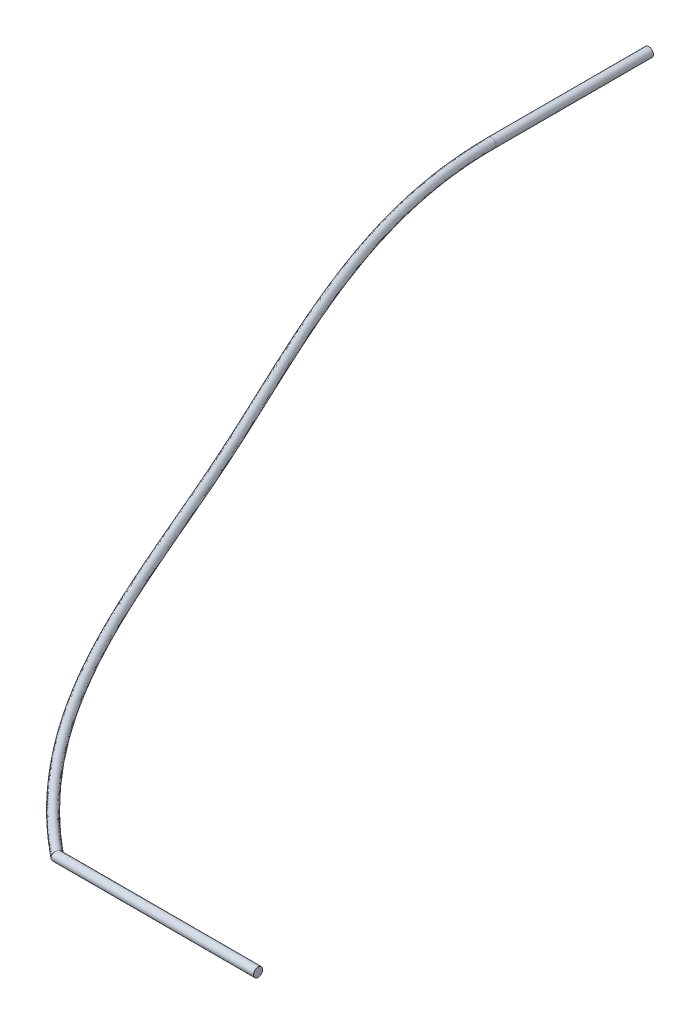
ISO-10303-21;
HEADER;
FILE_DESCRIPTION(('STEP AP214'),'2;1');
FILE_NAME('part.step','',(''),(''),'','','');
FILE_SCHEMA(('AUTOMOTIVE_DESIGN { 1 0 10303 214 1 1 1 1 }'));
ENDSEC;
DATA;
#1=APPLICATION_CONTEXT('core data for automotive mechanical design processes');
#2=APPLICATION_PROTOCOL_DEFINITION('international standard','automotive_design',2000,#1);
#3=PRODUCT_CONTEXT('',#1,'mechanical');
#4=PRODUCT('Part','Part','',(#3));
#5=PRODUCT_RELATED_PRODUCT_CATEGORY('part','',(#4));
#6=PRODUCT_DEFINITION_FORMATION('','',#4);
#7=PRODUCT_DEFINITION_CONTEXT('part definition',#1,'design');
#8=PRODUCT_DEFINITION('design','',#6,#7);
#9=PRODUCT_DEFINITION_SHAPE('','',#8);
#10=(LENGTH_UNIT() NAMED_UNIT(*) SI_UNIT(.MILLI.,.METRE.));
#11=(NAMED_UNIT(*) PLANE_ANGLE_UNIT() SI_UNIT($,.RADIAN.));
#12=(NAMED_UNIT(*) SI_UNIT($,.STERADIAN.) SOLID_ANGLE_UNIT());
#13=UNCERTAINTY_MEASURE_WITH_UNIT(LENGTH_MEASURE(1.E-05),#10,'distance_accuracy_value','');
#14=(GEOMETRIC_REPRESENTATION_CONTEXT(3) GLOBAL_UNCERTAINTY_ASSIGNED_CONTEXT((#13)) GLOBAL_UNIT_ASSIGNED_CONTEXT((#10,
#11,#12)) REPRESENTATION_CONTEXT('',''));
#15=CARTESIAN_POINT('',(0.,0.,0.));
#16=DIRECTION('',(0.,0.,1.));
#17=DIRECTION('',(1.,0.,0.));
#18=AXIS2_PLACEMENT_3D('',#15,#16,#17);
#19=CARTESIAN_POINT('',(52.7031861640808,0.,86.9387272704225));
#20=DIRECTION('',(1.,0.,0.));
#21=DIRECTION('',(0.,0.,-1.));
#22=AXIS2_PLACEMENT_3D('',#19,#20,#21);
#23=PLANE('',#22);
#24=CARTESIAN_POINT('',(52.7031861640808,0.,86.9387272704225));
#25=DIRECTION('',(1.,0.,0.));
#26=DIRECTION('',(0.,0.,-1.));
#27=AXIS2_PLACEMENT_3D('',#24,#25,#26);
#28=CIRCLE('',#27,0.4);
#29=CARTESIAN_POINT('',(52.7031861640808,0.,86.5387272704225));
#30=VERTEX_POINT('',#29);
#31=EDGE_CURVE('E38',#30,#30,#28,.T.);
#32=ORIENTED_EDGE('',*,*,#31,.T.);
#33=EDGE_LOOP('',(#32));
#34=FACE_BOUND('',#33,.T.);
#35=ADVANCED_FACE('F35',(#34),#23,.T.);
#36=CARTESIAN_POINT('',(0.,0.,0.));
#37=DIRECTION('',(0.,0.,1.));
#38=DIRECTION('',(1.,0.,0.));
#39=AXIS2_PLACEMENT_3D('',#36,#37,#38);
#40=PLANE('',#39);
#41=CARTESIAN_POINT('',(0.,0.,0.));
#42=DIRECTION('',(0.,0.,1.));
#43=DIRECTION('',(1.,0.,0.));
#44=AXIS2_PLACEMENT_3D('',#41,#42,#43);
#45=CIRCLE('',#44,0.4);
#46=CARTESIAN_POINT('',(0.4,0.,0.));
#47=VERTEX_POINT('',#46);
#48=EDGE_CURVE('E62',#47,#47,#45,.T.);
#49=ORIENTED_EDGE('',*,*,#48,.F.);
#50=EDGE_LOOP('',(#49));
#51=FACE_BOUND('',#50,.T.);
#52=ADVANCED_FACE('F83',(#51),#40,.F.);
#53=CARTESIAN_POINT('',(34.8420573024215,0.,86.9387272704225));
#54=DIRECTION('',(1.,0.,0.));
#55=DIRECTION('',(0.,0.,-1.));
#56=AXIS2_PLACEMENT_3D('',#53,#54,#55);
#57=CYLINDRICAL_SURFACE('',#56,0.4);
#58=CARTESIAN_POINT('',(35.0986006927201,-0.400000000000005,86.9387272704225));
#59=CARTESIAN_POINT('',(35.0980383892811,-0.400000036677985,86.9403077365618));
#60=CARTESIAN_POINT('',(35.0974760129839,-0.399990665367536,86.9418884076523));
#61=CARTESIAN_POINT('',(35.0885574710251,-0.39969296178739,86.9669557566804));
#62=CARTESIAN_POINT('',(35.0801942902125,-0.397338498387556,86.9904621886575));
#63=CARTESIAN_POINT('',(35.0636998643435,-0.388505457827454,87.0368232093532));
#64=CARTESIAN_POINT('',(35.0555693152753,-0.382015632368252,87.0596758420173));
#65=CARTESIAN_POINT('',(35.0397892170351,-0.36501893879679,87.1040291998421));
#66=CARTESIAN_POINT('',(35.0321397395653,-0.354511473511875,87.1255297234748));
#67=CARTESIAN_POINT('',(35.0175688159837,-0.329696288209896,87.1664845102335));
#68=CARTESIAN_POINT('',(35.0106471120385,-0.315389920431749,87.1859394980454));
#69=CARTESIAN_POINT('',(34.9979732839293,-0.283818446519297,87.2215621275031));
#70=CARTESIAN_POINT('',(34.9921912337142,-0.266660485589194,87.2378138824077));
#71=CARTESIAN_POINT('',(34.9817473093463,-0.229533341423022,87.2671688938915));
#72=CARTESIAN_POINT('',(34.9770851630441,-0.209564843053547,87.2802729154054));
#73=CARTESIAN_POINT('',(34.9693061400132,-0.16864006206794,87.30213763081));
#74=CARTESIAN_POINT('',(34.9661149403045,-0.147809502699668,87.3111072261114));
#75=CARTESIAN_POINT('',(34.961022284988,-0.104790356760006,87.3254212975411));
#76=CARTESIAN_POINT('',(34.9591203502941,-0.082602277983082,87.3307671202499));
#77=CARTESIAN_POINT('',(34.9567478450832,-0.0387181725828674,87.3374355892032));
#78=CARTESIAN_POINT('',(34.9562092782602,-0.0170546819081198,87.3389493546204));
#79=CARTESIAN_POINT('',(34.9563860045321,0.0262250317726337,87.3384526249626));
#80=CARTESIAN_POINT('',(34.9571011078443,0.0478412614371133,87.336442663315));
#81=CARTESIAN_POINT('',(34.9597295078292,0.0899568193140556,87.329054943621));
#82=CARTESIAN_POINT('',(34.9616181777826,0.110469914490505,87.3237464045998));
#83=CARTESIAN_POINT('',(34.9665051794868,0.150311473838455,87.3100103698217));
#84=CARTESIAN_POINT('',(34.9695050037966,0.169638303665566,87.3015786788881));
#85=CARTESIAN_POINT('',(34.9765728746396,0.20691757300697,87.2817128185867));
#86=CARTESIAN_POINT('',(34.9806588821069,0.224839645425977,87.2702281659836));
#87=CARTESIAN_POINT('',(34.989739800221,0.258504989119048,87.2447041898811));
#88=CARTESIAN_POINT('',(34.9947351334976,0.274247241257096,87.2306636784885));
#89=CARTESIAN_POINT('',(35.0060751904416,0.304805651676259,87.1987899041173));
#90=CARTESIAN_POINT('',(35.0125077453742,0.319332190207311,87.1807097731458));
#91=CARTESIAN_POINT('',(35.0260889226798,0.344948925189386,87.1425368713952));
#92=CARTESIAN_POINT('',(35.0332368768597,0.356042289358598,87.1224459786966));
#93=CARTESIAN_POINT('',(35.0480511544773,0.374611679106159,87.0808072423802));
#94=CARTESIAN_POINT('',(35.0557181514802,0.382082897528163,87.0592575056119));
#95=CARTESIAN_POINT('',(35.0713414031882,0.39324455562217,87.0153450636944));
#96=CARTESIAN_POINT('',(35.0792970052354,0.396943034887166,86.9929841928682));
#97=CARTESIAN_POINT('',(35.0904947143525,0.399453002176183,86.9615107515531));
#98=CARTESIAN_POINT('',(35.0937036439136,0.399864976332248,86.9524914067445));
#99=CARTESIAN_POINT('',(35.0974759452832,0.399990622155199,86.9418885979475));
#100=CARTESIAN_POINT('',(35.09803831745,0.399999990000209,86.9403079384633));
#101=CARTESIAN_POINT('',(35.0986006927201,0.400000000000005,86.9387272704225));
#102=B_SPLINE_CURVE_WITH_KNOTS('',3,(#58,#59,#60,#61,#62,#63,#64,#65,#66,#67,#68,#69,#70,#71,
#72,#73,#74,#75,#76,#77,#78,#79,#80,#81,#82,#83,#84,#85,#86,#87,#88,#89,#90,#91,#92,#93,#94,#95,
#96,#97,#98,#99,#100,#101),.UNSPECIFIED.,.F.,.F.,(4,2,2,2,2,2,2,2,2,2,2,2,2,2,2,2,2,2,2,2,2,4),
(0.,0.00503315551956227,0.0798146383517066,0.154800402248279,0.229797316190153,
0.304767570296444,0.377381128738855,0.449977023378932,0.518334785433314,0.586667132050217,
0.651517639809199,0.71635833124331,0.779882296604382,0.843491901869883,0.908226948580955,
0.972992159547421,1.04484114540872,1.11662363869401,1.18850113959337,1.26022514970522,
1.28895548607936,1.29398864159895),.UNSPECIFIED.);
#103=CARTESIAN_POINT('',(35.0986006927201,-0.400000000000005,86.9387272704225));
#104=VERTEX_POINT('',#103);
#105=CARTESIAN_POINT('',(35.0986006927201,0.400000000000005,86.9387272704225));
#106=VERTEX_POINT('',#105);
#107=EDGE_CURVE('E43',#104,#106,#102,.T.);
#108=ORIENTED_EDGE('',*,*,#107,.F.);
#109=CARTESIAN_POINT('',(35.0986006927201,-0.400000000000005,86.9387272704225));
#110=CARTESIAN_POINT('',(35.0991629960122,-0.40000003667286,86.9371468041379));
#111=CARTESIAN_POINT('',(35.0997253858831,-0.399990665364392,86.9355661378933));
#112=CARTESIAN_POINT('',(35.1086471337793,-0.399692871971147,86.9104911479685));
#113=CARTESIAN_POINT('',(35.1170165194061,-0.397336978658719,86.8869781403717));
#114=CARTESIAN_POINT('',(35.1335289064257,-0.388499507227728,86.8406063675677));
#115=CARTESIAN_POINT('',(35.1416712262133,-0.382006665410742,86.8177495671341));
#116=CARTESIAN_POINT('',(35.1574792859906,-0.365003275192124,86.7733902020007));
#117=CARTESIAN_POINT('',(35.1651449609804,-0.35449218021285,86.7518878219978));
#118=CARTESIAN_POINT('',(35.1797512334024,-0.329669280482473,86.7109306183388));
#119=CARTESIAN_POINT('',(35.1866920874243,-0.315358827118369,86.6914750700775));
#120=CARTESIAN_POINT('',(35.1994055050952,-0.283775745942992,86.6558489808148));
#121=CARTESIAN_POINT('',(35.2052078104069,-0.266609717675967,86.6395947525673));
#122=CARTESIAN_POINT('',(35.215690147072,-0.22946420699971,86.6102367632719));
#123=CARTESIAN_POINT('',(35.2203704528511,-0.209485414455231,86.5971322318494));
#124=CARTESIAN_POINT('',(35.2281790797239,-0.168543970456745,86.5752721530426));
#125=CARTESIAN_POINT('',(35.2313823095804,-0.147707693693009,86.5663066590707));
#126=CARTESIAN_POINT('',(35.2364935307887,-0.104676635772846,86.5520022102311));
#127=CARTESIAN_POINT('',(35.2384020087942,-0.0824823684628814,86.5466618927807));
#128=CARTESIAN_POINT('',(35.2407801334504,-0.038597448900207,86.5400075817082));
#129=CARTESIAN_POINT('',(35.2413187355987,-0.0169396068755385,86.5385006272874));
#130=CARTESIAN_POINT('',(35.2411370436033,0.0263275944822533,86.539008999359));
#131=CARTESIAN_POINT('',(35.2404169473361,0.0479369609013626,86.5410237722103));
#132=CARTESIAN_POINT('',(35.2377745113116,0.0900330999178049,86.5484177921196));
#133=CARTESIAN_POINT('',(35.2358771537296,0.110533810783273,86.5537271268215));
#134=CARTESIAN_POINT('',(35.2309699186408,0.15035118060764,86.567460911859));
#135=CARTESIAN_POINT('',(35.2279585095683,0.169666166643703,86.5758896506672));
#136=CARTESIAN_POINT('',(35.2208649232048,0.206927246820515,86.5957479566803));
#137=CARTESIAN_POINT('',(35.2167644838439,0.224842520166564,86.607228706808));
#138=CARTESIAN_POINT('',(35.207654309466,0.258494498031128,86.6327422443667));
#139=CARTESIAN_POINT('',(35.2026442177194,0.274230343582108,86.6467760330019));
#140=CARTESIAN_POINT('',(35.1916051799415,0.303889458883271,86.6777060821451));
#141=CARTESIAN_POINT('',(35.185538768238,0.317688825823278,86.6947077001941));
#142=CARTESIAN_POINT('',(35.1727592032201,0.342238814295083,86.7305350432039));
#143=CARTESIAN_POINT('',(35.1660466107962,0.352992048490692,86.749359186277));
#144=CARTESIAN_POINT('',(35.1514089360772,0.372254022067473,86.7904218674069));
#145=CARTESIAN_POINT('',(35.1434308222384,0.380402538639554,86.8128106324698));
#146=CARTESIAN_POINT('',(35.1271483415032,0.392587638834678,86.8585221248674));
#147=CARTESIAN_POINT('',(35.1188446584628,0.396632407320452,86.8818428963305));
#148=CARTESIAN_POINT('',(35.1070997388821,0.399401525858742,86.9148417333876));
#149=CARTESIAN_POINT('',(35.1036940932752,0.399858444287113,86.9244118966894));
#150=CARTESIAN_POINT('',(35.0997254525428,0.399990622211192,86.9355659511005));
#151=CARTESIAN_POINT('',(35.0991630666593,0.399999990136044,86.9371466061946));
#152=CARTESIAN_POINT('',(35.0986006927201,0.400000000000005,86.9387272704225));
#153=B_SPLINE_CURVE_WITH_KNOTS('',3,(#109,#110,#111,#112,#113,#114,#115,#116,#117,#118,#119,
#120,#121,#122,#123,#124,#125,#126,#127,#128,#129,#130,#131,#132,#133,#134,#135,#136,#137,#138,
#139,#140,#141,#142,#143,#144,#145,#146,#147,#148,#149,#150,#151,#152),.UNSPECIFIED.,.F.,.F.,(4,
2,2,2,2,2,2,2,2,2,2,2,2,2,2,2,2,2,2,2,2,4),(0.,0.00503315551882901,0.0798394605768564,
0.154850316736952,0.22987137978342,0.304865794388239,0.377515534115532,0.450147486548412,
0.51852071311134,0.586868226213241,0.651700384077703,0.71652235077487,0.780013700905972,
0.843592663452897,0.908313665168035,0.973060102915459,1.04092690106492,1.10873531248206,
1.1837536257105,1.25862202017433,1.2891078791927,1.29414103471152),.UNSPECIFIED.);
#154=EDGE_CURVE('E11',#104,#106,#153,.T.);
#155=ORIENTED_EDGE('',*,*,#154,.T.);
#156=EDGE_LOOP('',(#108,#155));
#157=FACE_BOUND('',#156,.T.);
#158=ORIENTED_EDGE('',*,*,#31,.F.);
#159=EDGE_LOOP('',(#158));
#160=FACE_BOUND('',#159,.T.);
#161=ADVANCED_FACE('F50',(#157,#160),#57,.T.);
#162=CARTESIAN_POINT('',(0.,0.,0.));
#163=DIRECTION('',(0.,0.,1.));
#164=DIRECTION('',(1.,0.,0.));
#165=AXIS2_PLACEMENT_3D('',#162,#163,#164);
#166=CYLINDRICAL_SURFACE('',#165,0.4);
#167=CARTESIAN_POINT('',(0.,0.,13.7801629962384));
#168=DIRECTION('',(0.,0.,1.));
#169=DIRECTION('',(1.,0.,0.));
#170=AXIS2_PLACEMENT_3D('',#167,#168,#169);
#171=CIRCLE('',#170,0.4);
#172=CARTESIAN_POINT('',(0.4,0.,13.7801629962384));
#173=VERTEX_POINT('',#172);
#174=EDGE_CURVE('E53',#173,#173,#171,.T.);
#175=ORIENTED_EDGE('',*,*,#174,.F.);
#176=EDGE_LOOP('',(#175));
#177=FACE_BOUND('',#176,.T.);
#178=ORIENTED_EDGE('',*,*,#48,.T.);
#179=EDGE_LOOP('',(#178));
#180=FACE_BOUND('',#179,.T.);
#181=ADVANCED_FACE('F57',(#177,#180),#166,.T.);
#182=CARTESIAN_POINT('',(0.4,0.,13.7801629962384));
#183=CARTESIAN_POINT('',(0.4,0.,14.1557957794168));
#184=CARTESIAN_POINT('',(0.406561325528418,0.,14.4969142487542));
#185=CARTESIAN_POINT('',(0.432323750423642,0.,15.2153948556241));
#186=CARTESIAN_POINT('',(0.451524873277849,0.,15.5752057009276));
#187=CARTESIAN_POINT('',(0.527363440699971,0.,16.6562900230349));
#188=CARTESIAN_POINT('',(0.602236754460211,0.,17.3792169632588));
#189=CARTESIAN_POINT('',(0.893987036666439,0.,19.5540618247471));
#190=CARTESIAN_POINT('',(1.17800967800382,0.,21.0120561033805));
#191=CARTESIAN_POINT('',(2.25168446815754,0.,25.4052139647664));
#192=CARTESIAN_POINT('',(3.26309523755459,0.,28.3594886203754));
#193=CARTESIAN_POINT('',(6.80133298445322,0.,37.2550862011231));
#194=CARTESIAN_POINT('',(9.83222421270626,0.,43.2275374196));
#195=CARTESIAN_POINT('',(15.6571630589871,0.,56.1358770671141));
#196=CARTESIAN_POINT('',(18.2860798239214,0.,63.0035758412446));
#197=CARTESIAN_POINT('',(23.3597556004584,0.,72.5537941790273));
#198=CARTESIAN_POINT('',(25.2388505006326,0.,75.6122210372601));
#199=CARTESIAN_POINT('',(29.6922712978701,0.,81.3929141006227));
#200=CARTESIAN_POINT('',(32.2538493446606,0.,84.1051906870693));
#201=CARTESIAN_POINT('',(35.4172742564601,0.,86.6824064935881));
#202=CARTESIAN_POINT('',(35.4838415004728,0.,86.7366371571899));
#203=CARTESIAN_POINT('',(35.5501395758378,0.,86.7906490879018));
#204=CARTESIAN_POINT('',(0.4,0.8,13.7801629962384));
#205=CARTESIAN_POINT('',(0.4,0.8,14.1557957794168));
#206=CARTESIAN_POINT('',(0.406561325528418,0.8,14.4969142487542));
#207=CARTESIAN_POINT('',(0.432323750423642,0.8,15.2153948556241));
#208=CARTESIAN_POINT('',(0.451524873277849,0.8,15.5752057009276));
#209=CARTESIAN_POINT('',(0.527363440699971,0.8,16.6562900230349));
#210=CARTESIAN_POINT('',(0.602236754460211,0.8,17.3792169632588));
#211=CARTESIAN_POINT('',(0.893987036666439,0.8,19.5540618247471));
#212=CARTESIAN_POINT('',(1.17800967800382,0.8,21.0120561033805));
#213=CARTESIAN_POINT('',(2.25168446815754,0.8,25.4052139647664));
#214=CARTESIAN_POINT('',(3.26309523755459,0.8,28.3594886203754));
#215=CARTESIAN_POINT('',(6.80133298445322,0.8,37.2550862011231));
#216=CARTESIAN_POINT('',(9.83222421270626,0.8,43.2275374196));
#217=CARTESIAN_POINT('',(15.6571630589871,0.8,56.1358770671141));
#218=CARTESIAN_POINT('',(18.2860798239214,0.8,63.0035758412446));
#219=CARTESIAN_POINT('',(23.3597556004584,0.8,72.5537941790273));
#220=CARTESIAN_POINT('',(25.2388505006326,0.8,75.6122210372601));
#221=CARTESIAN_POINT('',(29.6922712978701,0.8,81.3929141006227));
#222=CARTESIAN_POINT('',(32.2538493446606,0.8,84.1051906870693));
#223=CARTESIAN_POINT('',(35.4172742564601,0.8,86.6824064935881));
#224=CARTESIAN_POINT('',(35.4838415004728,0.8,86.7366371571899));
#225=CARTESIAN_POINT('',(35.5501395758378,0.8,86.7906490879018));
#226=CARTESIAN_POINT('',(-0.4,0.8,13.7801629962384));
#227=CARTESIAN_POINT('',(-0.4,0.8,14.1606820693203));
#228=CARTESIAN_POINT('',(-0.393259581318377,0.8,14.5162470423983));
#229=CARTESIAN_POINT('',(-0.366827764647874,0.8,15.2533961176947));
#230=CARTESIAN_POINT('',(-0.347136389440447,0.8,15.622315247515));
#231=CARTESIAN_POINT('',(-0.269430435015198,0.8,16.7300193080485));
#232=CARTESIAN_POINT('',(-0.192784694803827,0.8,17.469749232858));
#233=CARTESIAN_POINT('',(0.105337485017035,0.8,19.6920932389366));
#234=CARTESIAN_POINT('',(0.394983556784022,0.8,21.1778492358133));
#235=CARTESIAN_POINT('',(1.48635360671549,0.8,25.64341083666));
#236=CARTESIAN_POINT('',(2.51035767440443,0.8,28.6315740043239));
#237=CARTESIAN_POINT('',(6.07673921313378,0.8,37.5979287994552));
#238=CARTESIAN_POINT('',(9.11342722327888,0.8,43.5796310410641));
#239=CARTESIAN_POINT('',(14.9156613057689,0.8,56.4376558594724));
#240=CARTESIAN_POINT('',(17.5484203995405,0.8,63.3202344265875));
#241=CARTESIAN_POINT('',(22.668852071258,0.8,72.9584617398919));
#242=CARTESIAN_POINT('',(24.5713919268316,0.8,76.0566883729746));
#243=CARTESIAN_POINT('',(29.0922453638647,0.8,81.9249113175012));
#244=CARTESIAN_POINT('',(31.7233494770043,0.8,84.7048795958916));
#245=CARTESIAN_POINT('',(34.912522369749,0.8,87.303072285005));
#246=CARTESIAN_POINT('',(34.9785521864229,0.8,87.3568651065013));
#247=CARTESIAN_POINT('',(35.044850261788,0.8,87.4108770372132));
#248=CARTESIAN_POINT('',(-0.4,0.,13.7801629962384));
#249=CARTESIAN_POINT('',(-0.4,0.,14.1606820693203));
#250=CARTESIAN_POINT('',(-0.393259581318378,0.,14.5162470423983));
#251=CARTESIAN_POINT('',(-0.366827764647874,0.,15.2533961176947));
#252=CARTESIAN_POINT('',(-0.347136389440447,0.,15.622315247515));
#253=CARTESIAN_POINT('',(-0.269430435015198,0.,16.7300193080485));
#254=CARTESIAN_POINT('',(-0.192784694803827,0.,17.469749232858));
#255=CARTESIAN_POINT('',(0.105337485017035,0.,19.6920932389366));
#256=CARTESIAN_POINT('',(0.394983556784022,0.,21.1778492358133));
#257=CARTESIAN_POINT('',(1.48635360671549,0.,25.64341083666));
#258=CARTESIAN_POINT('',(2.51035767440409,0.,28.6315740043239));
#259=CARTESIAN_POINT('',(6.07673921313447,0.,37.5979287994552));
#260=CARTESIAN_POINT('',(9.11342722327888,0.,43.5796310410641));
#261=CARTESIAN_POINT('',(14.9156613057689,0.,56.4376558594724));
#262=CARTESIAN_POINT('',(17.5484203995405,0.,63.3202344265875));
#263=CARTESIAN_POINT('',(22.668852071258,0.,72.9584617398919));
#264=CARTESIAN_POINT('',(24.5713919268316,0.,76.0566883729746));
#265=CARTESIAN_POINT('',(29.0922453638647,0.,81.9249113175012));
#266=CARTESIAN_POINT('',(31.7233494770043,0.,84.7048795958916));
#267=CARTESIAN_POINT('',(34.912522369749,0.,87.303072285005));
#268=CARTESIAN_POINT('',(34.9785521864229,0.,87.3568651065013));
#269=CARTESIAN_POINT('',(35.044850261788,0.,87.4108770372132));
#270=CARTESIAN_POINT('',(-0.4,-0.8,13.7801629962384));
#271=CARTESIAN_POINT('',(-0.4,-0.8,14.1606820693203));
#272=CARTESIAN_POINT('',(-0.393259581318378,-0.8,14.5162470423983));
#273=CARTESIAN_POINT('',(-0.366827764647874,-0.8,15.2533961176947));
#274=CARTESIAN_POINT('',(-0.347136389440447,-0.8,15.622315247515));
#275=CARTESIAN_POINT('',(-0.269430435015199,-0.8,16.7300193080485));
#276=CARTESIAN_POINT('',(-0.192784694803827,-0.8,17.469749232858));
#277=CARTESIAN_POINT('',(0.105337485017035,-0.8,19.6920932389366));
#278=CARTESIAN_POINT('',(0.394983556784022,-0.8,21.1778492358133));
#279=CARTESIAN_POINT('',(1.48635360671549,-0.8,25.64341083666));
#280=CARTESIAN_POINT('',(2.51035767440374,-0.8,28.6315740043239));
#281=CARTESIAN_POINT('',(6.07673921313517,-0.8,37.5979287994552));
#282=CARTESIAN_POINT('',(9.11342722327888,-0.8,43.5796310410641));
#283=CARTESIAN_POINT('',(14.9156613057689,-0.8,56.4376558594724));
#284=CARTESIAN_POINT('',(17.5484203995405,-0.8,63.3202344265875));
#285=CARTESIAN_POINT('',(22.668852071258,-0.8,72.9584617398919));
#286=CARTESIAN_POINT('',(24.5713919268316,-0.8,76.0566883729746));
#287=CARTESIAN_POINT('',(29.0922453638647,-0.8,81.9249113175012));
#288=CARTESIAN_POINT('',(31.7233494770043,-0.8,84.7048795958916));
#289=CARTESIAN_POINT('',(34.912522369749,-0.8,87.303072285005));
#290=CARTESIAN_POINT('',(34.9785521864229,-0.8,87.3568651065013));
#291=CARTESIAN_POINT('',(35.044850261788,-0.8,87.4108770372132));
#292=CARTESIAN_POINT('',(0.4,-0.8,13.7801629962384));
#293=CARTESIAN_POINT('',(0.4,-0.8,14.1557957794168));
#294=CARTESIAN_POINT('',(0.406561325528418,-0.8,14.4969142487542));
#295=CARTESIAN_POINT('',(0.432323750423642,-0.8,15.2153948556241));
#296=CARTESIAN_POINT('',(0.451524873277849,-0.8,15.5752057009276));
#297=CARTESIAN_POINT('',(0.527363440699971,-0.8,16.6562900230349));
#298=CARTESIAN_POINT('',(0.602236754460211,-0.8,17.3792169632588));
#299=CARTESIAN_POINT('',(0.893987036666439,-0.8,19.5540618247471));
#300=CARTESIAN_POINT('',(1.17800967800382,-0.8,21.0120561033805));
#301=CARTESIAN_POINT('',(2.25168446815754,-0.8,25.4052139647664));
#302=CARTESIAN_POINT('',(3.26309523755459,-0.8,28.3594886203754));
#303=CARTESIAN_POINT('',(6.80133298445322,-0.8,37.2550862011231));
#304=CARTESIAN_POINT('',(9.83222421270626,-0.8,43.2275374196));
#305=CARTESIAN_POINT('',(15.6571630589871,-0.8,56.1358770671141));
#306=CARTESIAN_POINT('',(18.2860798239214,-0.8,63.0035758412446));
#307=CARTESIAN_POINT('',(23.3597556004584,-0.8,72.5537941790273));
#308=CARTESIAN_POINT('',(25.2388505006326,-0.8,75.6122210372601));
#309=CARTESIAN_POINT('',(29.6922712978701,-0.8,81.3929141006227));
#310=CARTESIAN_POINT('',(32.2538493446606,-0.8,84.1051906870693));
#311=CARTESIAN_POINT('',(35.4172742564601,-0.8,86.6824064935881));
#312=CARTESIAN_POINT('',(35.4838415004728,-0.8,86.7366371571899));
#313=CARTESIAN_POINT('',(35.5501395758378,-0.8,86.7906490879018));
#314=CARTESIAN_POINT('',(0.4,0.,13.7801629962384));
#315=CARTESIAN_POINT('',(0.4,0.,14.1557957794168));
#316=CARTESIAN_POINT('',(0.406561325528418,0.,14.4969142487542));
#317=CARTESIAN_POINT('',(0.432323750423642,0.,15.2153948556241));
#318=CARTESIAN_POINT('',(0.451524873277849,0.,15.5752057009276));
#319=CARTESIAN_POINT('',(0.527363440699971,0.,16.6562900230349));
#320=CARTESIAN_POINT('',(0.602236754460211,0.,17.3792169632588));
#321=CARTESIAN_POINT('',(0.893987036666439,0.,19.5540618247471));
#322=CARTESIAN_POINT('',(1.17800967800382,0.,21.0120561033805));
#323=CARTESIAN_POINT('',(2.25168446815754,0.,25.4052139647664));
#324=CARTESIAN_POINT('',(3.26309523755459,0.,28.3594886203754));
#325=CARTESIAN_POINT('',(6.80133298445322,0.,37.2550862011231));
#326=CARTESIAN_POINT('',(9.83222421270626,0.,43.2275374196));
#327=CARTESIAN_POINT('',(15.6571630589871,0.,56.1358770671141));
#328=CARTESIAN_POINT('',(18.2860798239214,0.,63.0035758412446));
#329=CARTESIAN_POINT('',(23.3597556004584,0.,72.5537941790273));
#330=CARTESIAN_POINT('',(25.2388505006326,0.,75.6122210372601));
#331=CARTESIAN_POINT('',(29.6922712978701,0.,81.3929141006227));
#332=CARTESIAN_POINT('',(32.2538493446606,0.,84.1051906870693));
#333=CARTESIAN_POINT('',(35.4172742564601,0.,86.6824064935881));
#334=CARTESIAN_POINT('',(35.4838415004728,0.,86.7366371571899));
#335=CARTESIAN_POINT('',(35.5501395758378,0.,86.7906490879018));
#336=(BOUNDED_SURFACE() B_SPLINE_SURFACE(3,3,((#182,#183,#184,#185,#186,#187,#188,#189,#190,
#191,#192,#193,#194,#195,#196,#197,#198,#199,#200,#201,#202,#203),(#204,#205,#206,#207,#208,
#209,#210,#211,#212,#213,#214,#215,#216,#217,#218,#219,#220,#221,#222,#223,#224,#225),(#226,
#227,#228,#229,#230,#231,#232,#233,#234,#235,#236,#237,#238,#239,#240,#241,#242,#243,#244,#245,
#246,#247),(#248,#249,#250,#251,#252,#253,#254,#255,#256,#257,#258,#259,#260,#261,#262,#263,
#264,#265,#266,#267,#268,#269),(#270,#271,#272,#273,#274,#275,#276,#277,#278,#279,#280,#281,
#282,#283,#284,#285,#286,#287,#288,#289,#290,#291),(#292,#293,#294,#295,#296,#297,#298,#299,
#300,#301,#302,#303,#304,#305,#306,#307,#308,#309,#310,#311,#312,#313),(#314,#315,#316,#317,
#318,#319,#320,#321,#322,#323,#324,#325,#326,#327,#328,#329,#330,#331,#332,#333,#334,#335)),
.UNSPECIFIED.,.T.,.F.,.F.) B_SPLINE_SURFACE_WITH_KNOTS((4,3,4),(4,2,2,2,2,2,2,2,2,2,4),(0.,0.5,
1.),(0.143240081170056,0.155501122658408,0.167762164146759,0.192284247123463,0.241328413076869,
0.339416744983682,0.535593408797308,0.767796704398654,0.883898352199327,1.,1.00247500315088),
.UNSPECIFIED.) GEOMETRIC_REPRESENTATION_ITEM() RATIONAL_B_SPLINE_SURFACE(((1.,1.,1.,1.,1.,1.,1.,
1.,1.,1.,1.,1.,1.,1.,1.,1.,1.,1.,1.,1.,1.,1.),(0.333333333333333,0.333333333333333,
0.333333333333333,0.333333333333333,0.333333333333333,0.333333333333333,0.333333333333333,
0.333333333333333,0.333333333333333,0.333333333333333,0.333333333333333,0.333333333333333,
0.333333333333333,0.333333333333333,0.333333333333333,0.333333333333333,0.333333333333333,
0.333333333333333,0.333333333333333,0.333333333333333,0.333333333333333,0.333333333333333),
(0.333333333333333,0.333333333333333,0.333333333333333,0.333333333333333,0.333333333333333,
0.333333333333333,0.333333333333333,0.333333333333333,0.333333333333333,0.333333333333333,
0.333333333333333,0.333333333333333,0.333333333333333,0.333333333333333,0.333333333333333,
0.333333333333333,0.333333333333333,0.333333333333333,0.333333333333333,0.333333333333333,
0.333333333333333,0.333333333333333),(1.,1.,1.,1.,1.,1.,1.,1.,1.,1.,1.,1.,1.,1.,1.,1.,1.,1.,1.,
1.,1.,1.),(0.333333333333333,0.333333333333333,0.333333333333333,0.333333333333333,
0.333333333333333,0.333333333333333,0.333333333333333,0.333333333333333,0.333333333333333,
0.333333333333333,0.333333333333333,0.333333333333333,0.333333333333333,0.333333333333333,
0.333333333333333,0.333333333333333,0.333333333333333,0.333333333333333,0.333333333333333,
0.333333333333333,0.333333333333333,0.333333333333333),(0.333333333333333,0.333333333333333,
0.333333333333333,0.333333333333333,0.333333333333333,0.333333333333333,0.333333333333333,
0.333333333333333,0.333333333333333,0.333333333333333,0.333333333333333,0.333333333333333,
0.333333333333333,0.333333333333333,0.333333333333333,0.333333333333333,0.333333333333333,
0.333333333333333,0.333333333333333,0.333333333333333,0.333333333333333,0.333333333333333),(1.,
1.,1.,1.,1.,1.,1.,1.,1.,1.,1.,1.,1.,1.,1.,1.,1.,1.,1.,1.,1.,1.))) REPRESENTATION_ITEM('') SURFACE());
#337=ORIENTED_EDGE('',*,*,#154,.F.);
#338=ORIENTED_EDGE('',*,*,#107,.T.);
#339=EDGE_LOOP('',(#337,#338));
#340=FACE_BOUND('',#339,.T.);
#341=ORIENTED_EDGE('',*,*,#174,.T.);
#342=EDGE_LOOP('',(#341));
#343=FACE_BOUND('',#342,.T.);
#344=ADVANCED_FACE('F54',(#340,#343),#336,.T.);
#345=CLOSED_SHELL('',(#35,#52,#161,#181,#344));
#346=MANIFOLD_SOLID_BREP('B2',#345);
#347=ADVANCED_BREP_SHAPE_REPRESENTATION('',(#18,#346),#14);
#348=SHAPE_DEFINITION_REPRESENTATION(#9,#347);
ENDSEC;
END-ISO-10303-21;
